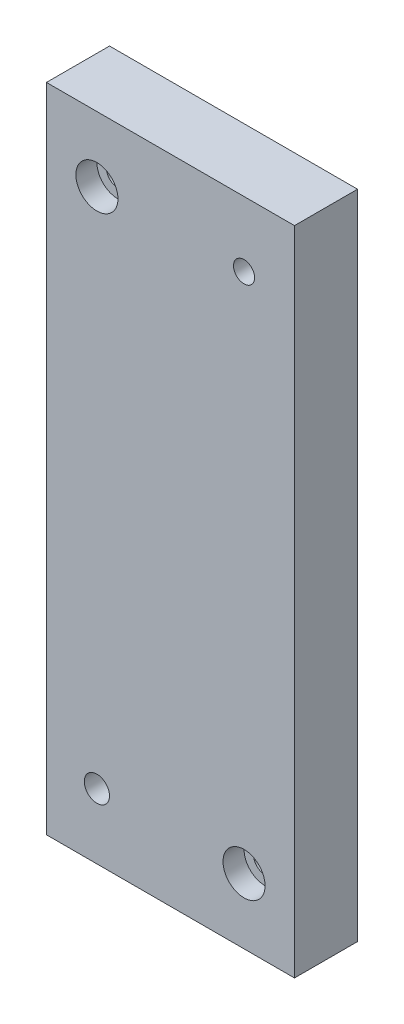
from build123d import *

# Parameters (mm, degrees)
ESQUISSE1_W                                     = 59
ESQUISSE1_H                                     = 155
ESQUISSE1_R                                     = 3.0035
ESQUISSE1_R_2                                   = 2.5035
EXTRUSION1_DEPTH                                = 15
CHAMBRAGE_POUR_VIS_T_TE_CYLINDRIQUE_D           = 5.5
CHAMBRAGE_POUR_VIS_T_TE_CYLINDRIQUE_CBORE_D     = 10
CHAMBRAGE_POUR_VIS_T_TE_CYLINDRIQUE_CBORE_DEPTH = 5


with BuildPart() as part:
    # Esquisse1 → Extrusion1 (new body)
    with BuildSketch(Plane.XY):
        Rectangle(ESQUISSE1_W, ESQUISSE1_H)
        with Locations((-17.5, -62)):
            Circle(ESQUISSE1_R, mode=Mode.SUBTRACT)
        with Locations((17.5, 62)):
            Circle(ESQUISSE1_R_2, mode=Mode.SUBTRACT)
    extrude(amount=EXTRUSION1_DEPTH)

    # Chambrage pour vis _ t_te cylindrique (through all)
    with Locations(Plane.XY.offset(15)):
        with Locations((-17.5, 62), (17.5, -62)):
            CounterBoreHole(CHAMBRAGE_POUR_VIS_T_TE_CYLINDRIQUE_D / 2, CHAMBRAGE_POUR_VIS_T_TE_CYLINDRIQUE_CBORE_D / 2, CHAMBRAGE_POUR_VIS_T_TE_CYLINDRIQUE_CBORE_DEPTH)


solid = part.part
